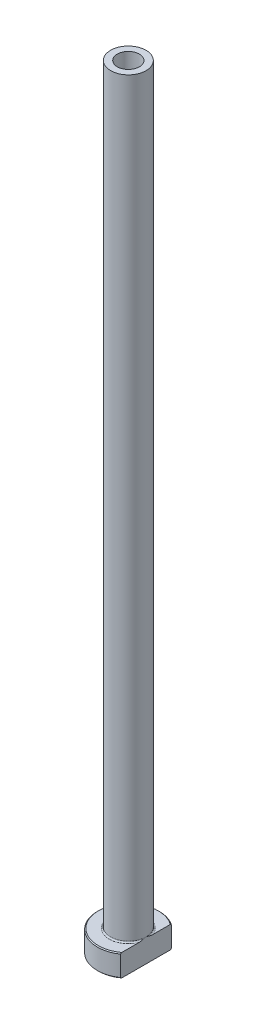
ISO-10303-21;
HEADER;
FILE_DESCRIPTION(('STEP AP214'),'2;1');
FILE_NAME('part.step','',(''),(''),'','','');
FILE_SCHEMA(('AUTOMOTIVE_DESIGN { 1 0 10303 214 1 1 1 1 }'));
ENDSEC;
DATA;
#1=APPLICATION_CONTEXT('core data for automotive mechanical design processes');
#2=APPLICATION_PROTOCOL_DEFINITION('international standard','automotive_design',2000,#1);
#3=PRODUCT_CONTEXT('',#1,'mechanical');
#4=PRODUCT('Part','Part','',(#3));
#5=PRODUCT_RELATED_PRODUCT_CATEGORY('part','',(#4));
#6=PRODUCT_DEFINITION_FORMATION('','',#4);
#7=PRODUCT_DEFINITION_CONTEXT('part definition',#1,'design');
#8=PRODUCT_DEFINITION('design','',#6,#7);
#9=PRODUCT_DEFINITION_SHAPE('','',#8);
#10=(LENGTH_UNIT() NAMED_UNIT(*) SI_UNIT(.MILLI.,.METRE.));
#11=(NAMED_UNIT(*) PLANE_ANGLE_UNIT() SI_UNIT($,.RADIAN.));
#12=(NAMED_UNIT(*) SI_UNIT($,.STERADIAN.) SOLID_ANGLE_UNIT());
#13=UNCERTAINTY_MEASURE_WITH_UNIT(LENGTH_MEASURE(1.E-05),#10,'distance_accuracy_value','');
#14=(GEOMETRIC_REPRESENTATION_CONTEXT(3) GLOBAL_UNCERTAINTY_ASSIGNED_CONTEXT((#13)) GLOBAL_UNIT_ASSIGNED_CONTEXT((#10,
#11,#12)) REPRESENTATION_CONTEXT('',''));
#15=CARTESIAN_POINT('',(0.,0.,0.));
#16=DIRECTION('',(0.,0.,1.));
#17=DIRECTION('',(1.,0.,0.));
#18=AXIS2_PLACEMENT_3D('',#15,#16,#17);
#19=CARTESIAN_POINT('',(0.,92.1876809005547,0.));
#20=DIRECTION('',(0.,1.,0.));
#21=DIRECTION('',(0.,0.,1.));
#22=AXIS2_PLACEMENT_3D('',#19,#20,#21);
#23=CYLINDRICAL_SURFACE('',#22,2.5);
#24=CARTESIAN_POINT('',(0.,175.,0.));
#25=DIRECTION('',(0.,1.,0.));
#26=DIRECTION('',(0.,0.,1.));
#27=AXIS2_PLACEMENT_3D('',#24,#25,#26);
#28=CIRCLE('',#27,2.5);
#29=CARTESIAN_POINT('',(0.,175.,2.5));
#30=VERTEX_POINT('',#29);
#31=EDGE_CURVE('E167',#30,#30,#28,.T.);
#32=ORIENTED_EDGE('',*,*,#31,.T.);
#33=EDGE_LOOP('',(#32));
#34=FACE_BOUND('',#33,.T.);
#35=CARTESIAN_POINT('',(0.,130.,0.));
#36=DIRECTION('',(0.,1.,0.));
#37=DIRECTION('',(0.,0.,1.));
#38=AXIS2_PLACEMENT_3D('',#35,#36,#37);
#39=CIRCLE('',#38,2.5);
#40=CARTESIAN_POINT('',(0.,130.,2.5));
#41=VERTEX_POINT('',#40);
#42=EDGE_CURVE('E170',#41,#41,#39,.T.);
#43=ORIENTED_EDGE('',*,*,#42,.F.);
#44=EDGE_LOOP('',(#43));
#45=FACE_BOUND('',#44,.T.);
#46=ADVANCED_FACE('F32',(#34,#45),#23,.F.);
#47=CARTESIAN_POINT('',(-2.5,175.,0.));
#48=DIRECTION('',(0.,1.,0.));
#49=DIRECTION('',(0.,0.,1.));
#50=AXIS2_PLACEMENT_3D('',#47,#48,#49);
#51=PLANE('',#50);
#52=CARTESIAN_POINT('',(0.,175.,0.));
#53=DIRECTION('',(0.,1.,0.));
#54=DIRECTION('',(0.,0.,1.));
#55=AXIS2_PLACEMENT_3D('',#52,#53,#54);
#56=CIRCLE('',#55,4.00000000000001);
#57=CARTESIAN_POINT('',(0.,175.,4.00000000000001));
#58=VERTEX_POINT('',#57);
#59=EDGE_CURVE('E174',#58,#58,#56,.T.);
#60=ORIENTED_EDGE('',*,*,#59,.T.);
#61=EDGE_LOOP('',(#60));
#62=FACE_BOUND('',#61,.T.);
#63=ORIENTED_EDGE('',*,*,#31,.F.);
#64=EDGE_LOOP('',(#63));
#65=FACE_BOUND('',#64,.T.);
#66=ADVANCED_FACE('F157',(#62,#65),#51,.T.);
#67=CARTESIAN_POINT('',(0.,92.1876809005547,0.));
#68=DIRECTION('',(0.,1.,0.));
#69=DIRECTION('',(0.,0.,1.));
#70=AXIS2_PLACEMENT_3D('',#67,#68,#69);
#71=CYLINDRICAL_SURFACE('',#70,4.);
#72=CARTESIAN_POINT('',(0.,5.3,0.));
#73=DIRECTION('',(0.,1.,0.));
#74=DIRECTION('',(0.,0.,1.));
#75=AXIS2_PLACEMENT_3D('',#72,#73,#74);
#76=CIRCLE('',#75,4.);
#77=CARTESIAN_POINT('',(4.,5.3,0.));
#78=VERTEX_POINT('',#77);
#79=EDGE_CURVE('E180',#78,#78,#76,.T.);
#80=ORIENTED_EDGE('',*,*,#79,.T.);
#81=EDGE_LOOP('',(#80));
#82=FACE_BOUND('',#81,.T.);
#83=ORIENTED_EDGE('',*,*,#59,.F.);
#84=EDGE_LOOP('',(#83));
#85=FACE_BOUND('',#84,.T.);
#86=ADVANCED_FACE('F162',(#82,#85),#71,.T.);
#87=CARTESIAN_POINT('',(-3.99999999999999,5.,0.));
#88=DIRECTION('',(0.,1.,0.));
#89=DIRECTION('',(0.,0.,1.));
#90=AXIS2_PLACEMENT_3D('',#87,#88,#89);
#91=PLANE('',#90);
#92=DIRECTION('',(0.,0.,1.));
#93=VECTOR('',#92,1.);
#94=CARTESIAN_POINT('',(4.,5.,0.));
#95=LINE('',#94,#93);
#96=CARTESIAN_POINT('',(4.,5.,-5.499090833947));
#97=VERTEX_POINT('',#96);
#98=CARTESIAN_POINT('',(4.,5.,-1.57797338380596));
#99=VERTEX_POINT('',#98);
#100=EDGE_CURVE('E54',#97,#99,#95,.T.);
#101=ORIENTED_EDGE('',*,*,#100,.F.);
#102=CARTESIAN_POINT('',(0.,5.,0.));
#103=DIRECTION('',(0.,1.,0.));
#104=DIRECTION('',(0.,0.,1.));
#105=AXIS2_PLACEMENT_3D('',#102,#103,#104);
#106=CIRCLE('',#105,6.79999999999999);
#107=CARTESIAN_POINT('',(3.99999999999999,5.,5.499090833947));
#108=VERTEX_POINT('',#107);
#109=EDGE_CURVE('E186',#97,#108,#106,.T.);
#110=ORIENTED_EDGE('',*,*,#109,.T.);
#111=CARTESIAN_POINT('',(4.,5.,1.57797338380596));
#112=VERTEX_POINT('',#111);
#113=EDGE_CURVE('E134',#112,#108,#95,.T.);
#114=ORIENTED_EDGE('',*,*,#113,.F.);
#115=CARTESIAN_POINT('',(0.,5.,0.));
#116=DIRECTION('',(0.,1.,0.));
#117=DIRECTION('',(0.,0.,1.));
#118=AXIS2_PLACEMENT_3D('',#115,#116,#117);
#119=CIRCLE('',#118,4.3);
#120=EDGE_CURVE('E183',#112,#99,#119,.F.);
#121=ORIENTED_EDGE('',*,*,#120,.T.);
#122=EDGE_LOOP('',(#101,#110,#114,#121));
#123=FACE_BOUND('',#122,.T.);
#124=ADVANCED_FACE('F197',(#123),#91,.T.);
#125=CARTESIAN_POINT('',(0.,92.1876809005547,0.));
#126=DIRECTION('',(0.,1.,0.));
#127=DIRECTION('',(0.,0.,1.));
#128=AXIS2_PLACEMENT_3D('',#125,#126,#127);
#129=CYLINDRICAL_SURFACE('',#128,6.99999999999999);
#130=DIRECTION('',(0.,-1.,0.));
#131=VECTOR('',#130,1.);
#132=CARTESIAN_POINT('',(3.99999999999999,175.,5.74456264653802));
#133=LINE('',#132,#131);
#134=CARTESIAN_POINT('',(3.99999999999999,4.79999999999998,5.74456264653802));
#135=VERTEX_POINT('',#134);
#136=CARTESIAN_POINT('',(3.99999999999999,0.20000000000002,5.74456264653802));
#137=VERTEX_POINT('',#136);
#138=EDGE_CURVE('E82',#135,#137,#133,.T.);
#139=ORIENTED_EDGE('',*,*,#138,.F.);
#140=CARTESIAN_POINT('',(0.,4.79999999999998,0.));
#141=DIRECTION('',(0.,1.,0.));
#142=DIRECTION('',(0.,0.,1.));
#143=AXIS2_PLACEMENT_3D('',#140,#141,#142);
#144=CIRCLE('',#143,6.99999999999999);
#145=CARTESIAN_POINT('',(4.,4.79999999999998,-5.74456264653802));
#146=VERTEX_POINT('',#145);
#147=EDGE_CURVE('E95',#135,#146,#144,.F.);
#148=ORIENTED_EDGE('',*,*,#147,.T.);
#149=DIRECTION('',(0.,-1.,0.));
#150=VECTOR('',#149,1.);
#151=CARTESIAN_POINT('',(4.,175.,-5.74456264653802));
#152=LINE('',#151,#150);
#153=CARTESIAN_POINT('',(4.,0.20000000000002,-5.74456264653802));
#154=VERTEX_POINT('',#153);
#155=EDGE_CURVE('E192',#146,#154,#152,.T.);
#156=ORIENTED_EDGE('',*,*,#155,.T.);
#157=CARTESIAN_POINT('',(0.,0.20000000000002,0.));
#158=DIRECTION('',(0.,-1.,0.));
#159=DIRECTION('',(0.,0.,-1.));
#160=AXIS2_PLACEMENT_3D('',#157,#158,#159);
#161=CIRCLE('',#160,6.99999999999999);
#162=EDGE_CURVE('E98',#154,#137,#161,.F.);
#163=ORIENTED_EDGE('',*,*,#162,.T.);
#164=EDGE_LOOP('',(#139,#148,#156,#163));
#165=FACE_BOUND('',#164,.T.);
#166=ADVANCED_FACE('F190',(#165),#129,.T.);
#167=CARTESIAN_POINT('',(-6.99999999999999,0.,0.));
#168=DIRECTION('',(0.,-1.,0.));
#169=DIRECTION('',(0.,0.,-1.));
#170=AXIS2_PLACEMENT_3D('',#167,#168,#169);
#171=PLANE('',#170);
#172=CARTESIAN_POINT('',(0.,0.,0.));
#173=DIRECTION('',(0.,-1.,0.));
#174=DIRECTION('',(0.,0.,-1.));
#175=AXIS2_PLACEMENT_3D('',#172,#173,#174);
#176=CIRCLE('',#175,3.24999999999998);
#177=CARTESIAN_POINT('',(0.,0.,-3.24999999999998));
#178=VERTEX_POINT('',#177);
#179=EDGE_CURVE('E40',#178,#178,#176,.F.);
#180=ORIENTED_EDGE('',*,*,#179,.T.);
#181=EDGE_LOOP('',(#180));
#182=FACE_BOUND('',#181,.T.);
#183=DIRECTION('',(0.,0.,-1.));
#184=VECTOR('',#183,1.);
#185=CARTESIAN_POINT('',(3.99999999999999,0.,5.74456264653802));
#186=LINE('',#185,#184);
#187=CARTESIAN_POINT('',(3.99999999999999,0.,5.49909083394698));
#188=VERTEX_POINT('',#187);
#189=CARTESIAN_POINT('',(4.,0.,-5.49909083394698));
#190=VERTEX_POINT('',#189);
#191=EDGE_CURVE('E47',#188,#190,#186,.T.);
#192=ORIENTED_EDGE('',*,*,#191,.F.);
#193=CARTESIAN_POINT('',(0.,0.,0.));
#194=DIRECTION('',(0.,-1.,0.));
#195=DIRECTION('',(0.,0.,-1.));
#196=AXIS2_PLACEMENT_3D('',#193,#194,#195);
#197=CIRCLE('',#196,6.79999999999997);
#198=EDGE_CURVE('E92',#188,#190,#197,.T.);
#199=ORIENTED_EDGE('',*,*,#198,.T.);
#200=EDGE_LOOP('',(#192,#199));
#201=FACE_BOUND('',#200,.T.);
#202=ADVANCED_FACE('F91',(#182,#201),#171,.T.);
#203=CARTESIAN_POINT('',(0.,92.1876809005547,0.));
#204=DIRECTION('',(0.,1.,0.));
#205=DIRECTION('',(0.,0.,1.));
#206=AXIS2_PLACEMENT_3D('',#203,#204,#205);
#207=CYLINDRICAL_SURFACE('',#206,2.75);
#208=CARTESIAN_POINT('',(0.,0.499999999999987,0.));
#209=DIRECTION('',(0.,-1.,0.));
#210=DIRECTION('',(0.,0.,-1.));
#211=AXIS2_PLACEMENT_3D('',#208,#209,#210);
#212=CIRCLE('',#211,2.75);
#213=CARTESIAN_POINT('',(0.,0.499999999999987,-2.75));
#214=VERTEX_POINT('',#213);
#215=EDGE_CURVE('E11',#214,#214,#212,.T.);
#216=ORIENTED_EDGE('',*,*,#215,.T.);
#217=EDGE_LOOP('',(#216));
#218=FACE_BOUND('',#217,.T.);
#219=CARTESIAN_POINT('',(0.,118.,0.));
#220=DIRECTION('',(0.,1.,0.));
#221=DIRECTION('',(0.,0.,1.));
#222=AXIS2_PLACEMENT_3D('',#219,#220,#221);
#223=CIRCLE('',#222,2.75);
#224=CARTESIAN_POINT('',(0.,118.,2.75));
#225=VERTEX_POINT('',#224);
#226=EDGE_CURVE('E172',#225,#225,#223,.T.);
#227=ORIENTED_EDGE('',*,*,#226,.T.);
#228=EDGE_LOOP('',(#227));
#229=FACE_BOUND('',#228,.T.);
#230=ADVANCED_FACE('F215',(#218,#229),#207,.F.);
#231=CARTESIAN_POINT('',(0.,118.,0.));
#232=DIRECTION('',(0.,-1.,0.));
#233=DIRECTION('',(0.,0.,-1.));
#234=AXIS2_PLACEMENT_3D('',#231,#232,#233);
#235=CONICAL_SURFACE('',#234,2.75,0.0208303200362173);
#236=ORIENTED_EDGE('',*,*,#42,.T.);
#237=EDGE_LOOP('',(#236));
#238=FACE_BOUND('',#237,.T.);
#239=ORIENTED_EDGE('',*,*,#226,.F.);
#240=EDGE_LOOP('',(#239));
#241=FACE_BOUND('',#240,.T.);
#242=ADVANCED_FACE('F111',(#238,#241),#235,.F.);
#243=CARTESIAN_POINT('',(0.,5.3,0.));
#244=DIRECTION('',(0.,1.,0.));
#245=DIRECTION('',(0.,0.,1.));
#246=AXIS2_PLACEMENT_3D('',#243,#244,#245);
#247=TOROIDAL_SURFACE('',#246,4.3,0.3);
#248=ORIENTED_EDGE('',*,*,#120,.F.);
#249=CARTESIAN_POINT('',(4.,5.3,0.));
#250=CARTESIAN_POINT('',(4.,5.30000062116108,-1.06261529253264E-10));
#251=CARTESIAN_POINT('',(4.,5.30000124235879,2.17726073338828E-07));
#252=CARTESIAN_POINT('',(4.,5.30000240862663,8.36141018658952E-07));
#253=CARTESIAN_POINT('',(4.,5.30000294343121,1.2501168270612E-06));
#254=CARTESIAN_POINT('',(4.,5.30000404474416,2.23959340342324E-06));
#255=CARTESIAN_POINT('',(4.,5.30000459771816,2.83084465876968E-06));
#256=CARTESIAN_POINT('',(4.,5.30000559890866,4.0651660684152E-06));
#257=CARTESIAN_POINT('',(4.,5.30000604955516,4.70640086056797E-06));
#258=CARTESIAN_POINT('',(4.,5.3000076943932,7.15677214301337E-06));
#259=CARTESIAN_POINT('',(4.,5.3000087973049,9.02995984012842E-06));
#260=CARTESIAN_POINT('',(4.,5.30001063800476,1.27664888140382E-05));
#261=CARTESIAN_POINT('',(4.,5.30001139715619,1.46197807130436E-05));
#262=CARTESIAN_POINT('',(4.,5.30001453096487,2.23679224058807E-05));
#263=CARTESIAN_POINT('',(4.,5.30001683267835,2.82968752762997E-05));
#264=CARTESIAN_POINT('',(4.,5.30002027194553,3.95668733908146E-05));
#265=CARTESIAN_POINT('',(4.,5.30002152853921,4.48715464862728E-05));
#266=CARTESIAN_POINT('',(4.,5.30003060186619,8.40118205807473E-05));
#267=CARTESIAN_POINT('',(4.,5.30003739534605,0.000118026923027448));
#268=CARTESIAN_POINT('',(4.,5.30006713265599,0.00025221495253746));
#269=CARTESIAN_POINT('',(4.,5.30009559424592,0.00035113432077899));
#270=CARTESIAN_POINT('',(3.99999999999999,5.30020622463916,0.000742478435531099));
#271=CARTESIAN_POINT('',(4.,5.30028475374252,0.00103561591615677));
#272=CARTESIAN_POINT('',(4.,5.30059889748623,0.00219920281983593));
#273=CARTESIAN_POINT('',(4.,5.3008390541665,0.00306873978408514));
#274=CARTESIAN_POINT('',(3.99999999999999,5.30183682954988,0.00669141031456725));
#275=CARTESIAN_POINT('',(4.,5.30258877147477,0.00944568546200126));
#276=CARTESIAN_POINT('',(4.,5.31066890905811,0.0390293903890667));
#277=CARTESIAN_POINT('',(4.,5.31802631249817,0.0658531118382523));
#278=CARTESIAN_POINT('',(3.99999999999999,5.3323967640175,0.118441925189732));
#279=CARTESIAN_POINT('',(4.,5.33941183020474,0.144206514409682));
#280=CARTESIAN_POINT('',(4.,5.35427366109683,0.199017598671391));
#281=CARTESIAN_POINT('',(4.,5.36211313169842,0.228066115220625));
#282=CARTESIAN_POINT('',(4.,5.3777634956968,0.28651184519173));
#283=CARTESIAN_POINT('',(4.,5.38557313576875,0.315909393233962));
#284=CARTESIAN_POINT('',(4.,5.40425662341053,0.386994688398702));
#285=CARTESIAN_POINT('',(4.,5.41505237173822,0.428703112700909));
#286=CARTESIAN_POINT('',(4.,5.43592310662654,0.511098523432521));
#287=CARTESIAN_POINT('',(4.,5.44600969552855,0.551782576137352));
#288=CARTESIAN_POINT('',(4.,5.47850986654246,0.686599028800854));
#289=CARTESIAN_POINT('',(4.,5.4997837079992,0.781011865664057));
#290=CARTESIAN_POINT('',(4.,5.53807543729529,0.971847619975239));
#291=CARTESIAN_POINT('',(4.,5.5550427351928,1.06828120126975));
#292=CARTESIAN_POINT('',(4.,5.5758240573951,1.21752725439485));
#293=CARTESIAN_POINT('',(4.,5.5820979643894,1.26999379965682));
#294=CARTESIAN_POINT('',(4.,5.59210686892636,1.37516324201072));
#295=CARTESIAN_POINT('',(4.,5.59584265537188,1.42786606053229));
#296=CARTESIAN_POINT('',(4.,5.60010438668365,1.53310673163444));
#297=CARTESIAN_POINT('',(4.,5.6006487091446,1.58564378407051));
#298=CARTESIAN_POINT('',(4.,5.59767158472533,1.69058605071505));
#299=CARTESIAN_POINT('',(4.,5.59415502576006,1.74299134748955));
#300=CARTESIAN_POINT('',(4.,5.58503062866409,1.81903290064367));
#301=CARTESIAN_POINT('',(4.,5.58157617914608,1.84292934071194));
#302=CARTESIAN_POINT('',(4.,5.57329952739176,1.89051061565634));
#303=CARTESIAN_POINT('',(4.,5.56847619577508,1.91419525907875));
#304=CARTESIAN_POINT('',(4.,5.5572664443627,1.96092888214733));
#305=CARTESIAN_POINT('',(4.,5.55089740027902,1.98398195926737));
#306=CARTESIAN_POINT('',(4.,5.53623434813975,2.02945550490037));
#307=CARTESIAN_POINT('',(4.,5.52794253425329,2.05187666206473));
#308=CARTESIAN_POINT('',(4.,5.50887098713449,2.09590631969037));
#309=CARTESIAN_POINT('',(4.,5.49806837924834,2.1175050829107));
#310=CARTESIAN_POINT('',(4.,5.4733340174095,2.15885583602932));
#311=CARTESIAN_POINT('',(4.,5.45941272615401,2.17861369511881));
#312=CARTESIAN_POINT('',(4.,5.43588221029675,2.20522942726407));
#313=CARTESIAN_POINT('',(4.,5.42781139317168,2.21344043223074));
#314=CARTESIAN_POINT('',(4.,5.4106511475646,2.22875149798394));
#315=CARTESIAN_POINT('',(4.,5.40156129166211,2.23585108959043));
#316=CARTESIAN_POINT('',(4.,5.38220524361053,2.24859694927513));
#317=CARTESIAN_POINT('',(4.,5.37192420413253,2.25422119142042));
#318=CARTESIAN_POINT('',(4.,5.35045072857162,2.26331064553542));
#319=CARTESIAN_POINT('',(4.,5.3392612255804,2.26678251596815));
#320=CARTESIAN_POINT('',(4.,5.31952044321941,2.27051268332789));
#321=CARTESIAN_POINT('',(4.,5.31108453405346,2.27139016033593));
#322=CARTESIAN_POINT('',(4.,5.29418624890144,2.27168963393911));
#323=CARTESIAN_POINT('',(4.,5.28572387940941,2.27111196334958));
#324=CARTESIAN_POINT('',(4.,5.26904138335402,2.26855580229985));
#325=CARTESIAN_POINT('',(4.,5.2608206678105,2.26658107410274));
#326=CARTESIAN_POINT('',(4.,5.2447821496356,2.26139496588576));
#327=CARTESIAN_POINT('',(4.,5.2369646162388,2.25818277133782));
#328=CARTESIAN_POINT('',(4.,5.21851235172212,2.24908332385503));
#329=CARTESIAN_POINT('',(4.,5.20815219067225,2.24264095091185));
#330=CARTESIAN_POINT('',(4.,5.1885797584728,2.22819957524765));
#331=CARTESIAN_POINT('',(4.,5.17937061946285,2.22019647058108));
#332=CARTESIAN_POINT('',(4.,5.1566538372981,2.19777756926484));
#333=CARTESIAN_POINT('',(4.,5.14403484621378,2.18246908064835));
#334=CARTESIAN_POINT('',(4.,5.12118369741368,2.15020843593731));
#335=CARTESIAN_POINT('',(4.,5.1109548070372,2.13325407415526));
#336=CARTESIAN_POINT('',(4.,5.09273574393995,2.09892324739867));
#337=CARTESIAN_POINT('',(4.,5.08468212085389,2.08157988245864));
#338=CARTESIAN_POINT('',(4.,5.07005901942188,2.04627072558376));
#339=CARTESIAN_POINT('',(4.,5.06349101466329,2.02830433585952));
#340=CARTESIAN_POINT('',(4.,5.04555485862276,1.97350761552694));
#341=CARTESIAN_POINT('',(4.,5.03608974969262,1.93605770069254));
#342=CARTESIAN_POINT('',(4.,5.01780569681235,1.84529235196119));
#343=CARTESIAN_POINT('',(4.,5.01077018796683,1.79164082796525));
#344=CARTESIAN_POINT('',(4.,5.00182846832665,1.68379947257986));
#345=CARTESIAN_POINT('',(4.,4.99993887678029,1.62960846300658));
#346=CARTESIAN_POINT('',(4.,5.0000612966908,1.52361204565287));
#347=CARTESIAN_POINT('',(4.,5.00190698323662,1.47180551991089));
#348=CARTESIAN_POINT('',(4.,5.00841243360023,1.36835357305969));
#349=CARTESIAN_POINT('',(4.,5.01307376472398,1.31670825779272));
#350=CARTESIAN_POINT('',(4.,5.02905484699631,1.17431887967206));
#351=CARTESIAN_POINT('',(4.,5.04274090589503,1.08384207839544));
#352=CARTESIAN_POINT('',(4.,5.06701714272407,0.947757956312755));
#353=CARTESIAN_POINT('',(4.,5.07585573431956,0.901814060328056));
#354=CARTESIAN_POINT('',(4.,5.09458665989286,0.810008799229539));
#355=CARTESIAN_POINT('',(4.,5.10448180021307,0.764148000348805));
#356=CARTESIAN_POINT('',(4.,5.12892434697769,0.655631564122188));
#357=CARTESIAN_POINT('',(3.99999999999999,5.14383556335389,0.593058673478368));
#358=CARTESIAN_POINT('',(4.,5.17458762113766,0.468885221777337));
#359=CARTESIAN_POINT('',(4.,5.19041623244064,0.407281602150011));
#360=CARTESIAN_POINT('',(3.99999999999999,5.22090834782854,0.291232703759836));
#361=CARTESIAN_POINT('',(3.99999999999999,5.23550024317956,0.2367683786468));
#362=CARTESIAN_POINT('',(4.00000000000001,5.26562550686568,0.125604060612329));
#363=CARTESIAN_POINT('',(4.00000000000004,5.28117250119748,0.0689076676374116));
#364=CARTESIAN_POINT('',(3.99999999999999,5.29741226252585,0.00944154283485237));
#365=CARTESIAN_POINT('',(3.99999999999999,5.29816540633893,0.00668315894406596));
#366=CARTESIAN_POINT('',(4.,5.29916346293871,0.00305954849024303));
#367=CARTESIAN_POINT('',(4.,5.29940273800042,0.00219318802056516));
#368=CARTESIAN_POINT('',(3.99999999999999,5.29971580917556,0.00103357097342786));
#369=CARTESIAN_POINT('',(3.99999999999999,5.29979412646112,0.000741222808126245));
#370=CARTESIAN_POINT('',(4.,5.29990450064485,0.00035080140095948));
#371=CARTESIAN_POINT('',(4.,5.29993292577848,0.000252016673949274));
#372=CARTESIAN_POINT('',(3.99999999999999,5.29996263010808,0.000117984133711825));
#373=CARTESIAN_POINT('',(3.99999999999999,5.29996941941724,8.39881898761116E-05));
#374=CARTESIAN_POINT('',(4.,5.29997848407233,4.48674015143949E-05));
#375=CARTESIAN_POINT('',(4.,5.29997973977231,3.95638189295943E-05));
#376=CARTESIAN_POINT('',(4.,5.29998317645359,2.8296033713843E-05));
#377=CARTESIAN_POINT('',(4.,5.29998547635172,2.23681454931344E-05));
#378=CARTESIAN_POINT('',(4.,5.29998860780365,1.46211000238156E-05));
#379=CARTESIAN_POINT('',(4.,5.29998936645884,1.2767889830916E-05));
#380=CARTESIAN_POINT('',(4.,5.29999120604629,9.03144036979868E-06));
#381=CARTESIAN_POINT('',(4.,5.29999230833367,7.15824074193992E-06));
#382=CARTESIAN_POINT('',(4.,5.29999395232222,4.70775514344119E-06));
#383=CARTESIAN_POINT('',(4.,5.29999440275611,4.06646377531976E-06));
#384=CARTESIAN_POINT('',(4.,5.29999540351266,2.83199084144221E-06));
#385=CARTESIAN_POINT('',(4.,5.29999595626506,2.24064341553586E-06));
#386=CARTESIAN_POINT('',(4.,5.2999970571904,1.25093972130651E-06));
#387=CARTESIAN_POINT('',(4.,5.29999759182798,8.36841075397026E-07));
#388=CARTESIAN_POINT('',(4.,5.29999875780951,2.18117755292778E-07));
#389=CARTESIAN_POINT('',(4.,5.29999937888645,1.06254606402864E-10));
#390=CARTESIAN_POINT('',(4.,5.3,0.));
#391=B_SPLINE_CURVE_WITH_KNOTS('',3,(#249,#250,#251,#252,#253,#254,#255,#256,#257,#258,#259,
#260,#261,#262,#263,#264,#265,#266,#267,#268,#269,#270,#271,#272,#273,#274,#275,#276,#277,#278,
#279,#280,#281,#282,#283,#284,#285,#286,#287,#288,#289,#290,#291,#292,#293,#294,#295,#296,#297,
#298,#299,#300,#301,#302,#303,#304,#305,#306,#307,#308,#309,#310,#311,#312,#313,#314,#315,#316,
#317,#318,#319,#320,#321,#322,#323,#324,#325,#326,#327,#328,#329,#330,#331,#332,#333,#334,#335,
#336,#337,#338,#339,#340,#341,#342,#343,#344,#345,#346,#347,#348,#349,#350,#351,#352,#353,#354,
#355,#356,#357,#358,#359,#360,#361,#362,#363,#364,#365,#366,#367,#368,#369,#370,#371,#372,#373,
#374,#375,#376,#377,#378,#379,#380,#381,#382,#383,#384,#385,#386,#387,#388,#389,#390),
.UNSPECIFIED.,.T.,.F.,(4,2,2,2,2,2,2,2,2,2,2,2,2,2,2,2,2,2,2,2,2,2,2,2,2,2,2,2,2,2,2,2,2,2,2,2,
2,2,2,2,2,2,2,2,2,2,2,2,2,2,2,2,2,2,2,2,2,2,2,2,2,2,2,2,2,2,2,2,2,2,4),(0.,1.87484430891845E-06,
3.90180055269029E-06,6.31683886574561E-06,8.66652039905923E-06,1.51627563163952E-05,
2.1165794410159E-05,4.020907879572E-05,5.65429486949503E-05,0.000160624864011,
0.000469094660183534,0.00137985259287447,0.00408571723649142,0.0126514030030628,
0.0960918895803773,0.176200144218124,0.266463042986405,0.357714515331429,0.486961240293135,
0.61270708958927,0.902988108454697,1.196535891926,1.35501075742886,1.51343634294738,
1.67094875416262,1.82827177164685,1.90067591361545,1.97313996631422,2.04482437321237,
2.11642737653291,2.18871023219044,2.26075412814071,2.29521947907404,2.32969934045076,
2.36466792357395,2.39952778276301,2.42485422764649,2.45017488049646,2.47542760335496,
2.50069697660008,2.53708899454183,2.57357798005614,2.63276032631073,2.69202310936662,
2.74930315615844,2.80663977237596,2.92223125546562,3.08420752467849,3.24670629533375,
3.40212850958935,3.55763731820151,3.83192962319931,3.97228382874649,4.11302057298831,
4.30598130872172,4.49678885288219,4.66594443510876,4.84230602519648,4.85088453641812,
4.85358051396,4.8544888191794,4.85479687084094,4.8549008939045,4.8549172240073,4.85493626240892,
4.85494226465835,4.85494875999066,4.85495110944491,4.85495352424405,4.85495555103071,
4.85495742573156),.UNSPECIFIED.);
#392=EDGE_CURVE('E126',#112,#78,#391,.T.);
#393=ORIENTED_EDGE('',*,*,#392,.T.);
#394=ORIENTED_EDGE('',*,*,#79,.F.);
#395=CARTESIAN_POINT('',(4.,5.3,0.));
#396=CARTESIAN_POINT('',(4.,5.29999937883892,1.06262853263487E-10));
#397=CARTESIAN_POINT('',(4.,5.29999875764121,-2.17726072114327E-07));
#398=CARTESIAN_POINT('',(4.,5.29999759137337,-8.36141017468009E-07));
#399=CARTESIAN_POINT('',(4.,5.29999705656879,-1.25011682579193E-06));
#400=CARTESIAN_POINT('',(4.,5.29999595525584,-2.23959340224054E-06));
#401=CARTESIAN_POINT('',(4.,5.29999540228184,-2.83084465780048E-06));
#402=CARTESIAN_POINT('',(4.,5.29999440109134,-4.06516606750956E-06));
#403=CARTESIAN_POINT('',(4.,5.29999395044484,-4.70640085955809E-06));
#404=CARTESIAN_POINT('',(4.,5.2999923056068,-7.15677214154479E-06));
#405=CARTESIAN_POINT('',(4.,5.2999912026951,-9.02995983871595E-06));
#406=CARTESIAN_POINT('',(4.,5.29998936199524,-1.27664888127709E-05));
#407=CARTESIAN_POINT('',(4.,5.29998860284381,-1.46197807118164E-05));
#408=CARTESIAN_POINT('',(4.,5.29998546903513,-2.2367922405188E-05));
#409=CARTESIAN_POINT('',(4.,5.29998316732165,-2.82968752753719E-05));
#410=CARTESIAN_POINT('',(4.,5.29997972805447,-3.95668733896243E-05));
#411=CARTESIAN_POINT('',(4.,5.29997847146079,-4.48715464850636E-05));
#412=CARTESIAN_POINT('',(4.,5.29996939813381,-8.40118205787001E-05));
#413=CARTESIAN_POINT('',(4.,5.29996260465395,-0.000118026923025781));
#414=CARTESIAN_POINT('',(4.,5.29993286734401,-0.000252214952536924));
#415=CARTESIAN_POINT('',(4.,5.29990440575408,-0.000351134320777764));
#416=CARTESIAN_POINT('',(3.99999999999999,5.29979377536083,-0.000742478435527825));
#417=CARTESIAN_POINT('',(4.,5.29971524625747,-0.00103561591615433));
#418=CARTESIAN_POINT('',(4.,5.29940110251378,-0.00219920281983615));
#419=CARTESIAN_POINT('',(4.,5.2991609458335,-0.00306873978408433));
#420=CARTESIAN_POINT('',(3.99999999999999,5.29816317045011,-0.00669141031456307));
#421=CARTESIAN_POINT('',(4.,5.29741122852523,-0.00944568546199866));
#422=CARTESIAN_POINT('',(4.,5.28933109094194,-0.0390293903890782));
#423=CARTESIAN_POINT('',(4.,5.28197368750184,-0.0658531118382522));
#424=CARTESIAN_POINT('',(3.99999999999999,5.26760323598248,-0.118441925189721));
#425=CARTESIAN_POINT('',(4.,5.26058816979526,-0.144206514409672));
#426=CARTESIAN_POINT('',(4.,5.24572633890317,-0.199017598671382));
#427=CARTESIAN_POINT('',(4.,5.23788686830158,-0.228066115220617));
#428=CARTESIAN_POINT('',(4.,5.2222365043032,-0.286511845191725));
#429=CARTESIAN_POINT('',(4.,5.21442686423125,-0.315909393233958));
#430=CARTESIAN_POINT('',(4.,5.19574337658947,-0.386994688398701));
#431=CARTESIAN_POINT('',(4.,5.18494762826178,-0.428703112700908));
#432=CARTESIAN_POINT('',(4.,5.16407689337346,-0.511098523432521));
#433=CARTESIAN_POINT('',(4.,5.15399030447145,-0.551782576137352));
#434=CARTESIAN_POINT('',(4.,5.12149013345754,-0.686599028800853));
#435=CARTESIAN_POINT('',(4.,5.1002162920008,-0.781011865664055));
#436=CARTESIAN_POINT('',(4.,5.06192456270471,-0.971847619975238));
#437=CARTESIAN_POINT('',(4.,5.0449572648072,-1.06828120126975));
#438=CARTESIAN_POINT('',(4.,5.02417594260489,-1.21752725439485));
#439=CARTESIAN_POINT('',(4.,5.01790203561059,-1.26999379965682));
#440=CARTESIAN_POINT('',(4.,5.00789313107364,-1.37516324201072));
#441=CARTESIAN_POINT('',(4.,5.00415734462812,-1.42786606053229));
#442=CARTESIAN_POINT('',(4.,4.99989561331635,-1.53310673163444));
#443=CARTESIAN_POINT('',(4.,4.9993512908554,-1.58564378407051));
#444=CARTESIAN_POINT('',(4.,5.00232841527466,-1.69058605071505));
#445=CARTESIAN_POINT('',(4.,5.00584497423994,-1.74299134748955));
#446=CARTESIAN_POINT('',(4.,5.0149693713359,-1.81903290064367));
#447=CARTESIAN_POINT('',(4.,5.01842382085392,-1.84292934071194));
#448=CARTESIAN_POINT('',(4.,5.02670047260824,-1.89051061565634));
#449=CARTESIAN_POINT('',(4.,5.03152380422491,-1.91419525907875));
#450=CARTESIAN_POINT('',(4.,5.0427335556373,-1.96092888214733));
#451=CARTESIAN_POINT('',(4.,5.04910259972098,-1.98398195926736));
#452=CARTESIAN_POINT('',(4.,5.06376565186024,-2.02945550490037));
#453=CARTESIAN_POINT('',(4.,5.07205746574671,-2.05187666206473));
#454=CARTESIAN_POINT('',(4.,5.09112901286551,-2.09590631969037));
#455=CARTESIAN_POINT('',(4.,5.10193162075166,-2.1175050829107));
#456=CARTESIAN_POINT('',(4.,5.1266659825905,-2.15885583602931));
#457=CARTESIAN_POINT('',(4.,5.14058727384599,-2.17861369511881));
#458=CARTESIAN_POINT('',(4.,5.16411778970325,-2.20522942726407));
#459=CARTESIAN_POINT('',(4.,5.17218860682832,-2.21344043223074));
#460=CARTESIAN_POINT('',(4.,5.1893488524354,-2.22875149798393));
#461=CARTESIAN_POINT('',(4.,5.19843870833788,-2.23585108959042));
#462=CARTESIAN_POINT('',(4.,5.21779475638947,-2.24859694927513));
#463=CARTESIAN_POINT('',(4.,5.22807579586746,-2.25422119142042));
#464=CARTESIAN_POINT('',(4.,5.24954927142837,-2.26331064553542));
#465=CARTESIAN_POINT('',(4.,5.2607387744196,-2.26678251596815));
#466=CARTESIAN_POINT('',(4.,5.28047955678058,-2.27051268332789));
#467=CARTESIAN_POINT('',(4.,5.28891546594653,-2.27139016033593));
#468=CARTESIAN_POINT('',(4.,5.30581375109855,-2.27168963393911));
#469=CARTESIAN_POINT('',(4.,5.31427612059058,-2.27111196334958));
#470=CARTESIAN_POINT('',(4.,5.33095861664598,-2.26855580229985));
#471=CARTESIAN_POINT('',(4.,5.3391793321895,-2.26658107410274));
#472=CARTESIAN_POINT('',(4.,5.35521785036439,-2.26139496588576));
#473=CARTESIAN_POINT('',(4.,5.3630353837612,-2.25818277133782));
#474=CARTESIAN_POINT('',(4.,5.38148764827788,-2.24908332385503));
#475=CARTESIAN_POINT('',(4.,5.39184780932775,-2.24264095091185));
#476=CARTESIAN_POINT('',(4.,5.4114202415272,-2.22819957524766));
#477=CARTESIAN_POINT('',(4.,5.42062938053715,-2.22019647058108));
#478=CARTESIAN_POINT('',(4.,5.44334616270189,-2.19777756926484));
#479=CARTESIAN_POINT('',(4.,5.45596515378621,-2.18246908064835));
#480=CARTESIAN_POINT('',(4.,5.47881630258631,-2.15020843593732));
#481=CARTESIAN_POINT('',(4.,5.48904519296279,-2.13325407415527));
#482=CARTESIAN_POINT('',(4.,5.50726425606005,-2.09892324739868));
#483=CARTESIAN_POINT('',(4.,5.51531787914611,-2.08157988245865));
#484=CARTESIAN_POINT('',(4.,5.52994098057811,-2.04627072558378));
#485=CARTESIAN_POINT('',(4.,5.5365089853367,-2.02830433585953));
#486=CARTESIAN_POINT('',(4.,5.55444514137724,-1.97350761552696));
#487=CARTESIAN_POINT('',(4.,5.56391025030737,-1.93605770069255));
#488=CARTESIAN_POINT('',(4.,5.58219430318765,-1.84529235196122));
#489=CARTESIAN_POINT('',(4.,5.58922981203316,-1.79164082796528));
#490=CARTESIAN_POINT('',(4.,5.59817153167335,-1.68379947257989));
#491=CARTESIAN_POINT('',(4.,5.60006112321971,-1.62960846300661));
#492=CARTESIAN_POINT('',(4.,5.5999387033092,-1.52361204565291));
#493=CARTESIAN_POINT('',(4.,5.59809301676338,-1.47180551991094));
#494=CARTESIAN_POINT('',(4.,5.59158756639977,-1.36835357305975));
#495=CARTESIAN_POINT('',(4.,5.58692623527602,-1.31670825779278));
#496=CARTESIAN_POINT('',(4.,5.57094515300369,-1.17431887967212));
#497=CARTESIAN_POINT('',(4.,5.55725909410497,-1.08384207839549));
#498=CARTESIAN_POINT('',(4.,5.53298285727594,-0.947757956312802));
#499=CARTESIAN_POINT('',(4.,5.52414426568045,-0.901814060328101));
#500=CARTESIAN_POINT('',(4.,5.50541334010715,-0.810008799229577));
#501=CARTESIAN_POINT('',(4.,5.49551819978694,-0.764148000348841));
#502=CARTESIAN_POINT('',(4.,5.47107565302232,-0.655631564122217));
#503=CARTESIAN_POINT('',(4.,5.45616443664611,-0.593058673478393));
#504=CARTESIAN_POINT('',(4.,5.42541237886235,-0.468885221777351));
#505=CARTESIAN_POINT('',(4.,5.40958376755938,-0.407281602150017));
#506=CARTESIAN_POINT('',(3.99999999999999,5.37909165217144,-0.291232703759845));
#507=CARTESIAN_POINT('',(3.99999999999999,5.36449975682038,-0.236768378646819));
#508=CARTESIAN_POINT('',(4.,5.33437449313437,-0.125604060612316));
#509=CARTESIAN_POINT('',(4.,5.31882749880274,-0.0689076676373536));
#510=CARTESIAN_POINT('',(4.,5.30258773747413,-0.00944154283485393));
#511=CARTESIAN_POINT('',(3.99999999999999,5.30183459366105,-0.00668315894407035));
#512=CARTESIAN_POINT('',(4.,5.30083653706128,-0.00305954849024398));
#513=CARTESIAN_POINT('',(4.,5.30059726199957,-0.00219318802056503));
#514=CARTESIAN_POINT('',(4.,5.30028419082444,-0.0010335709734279));
#515=CARTESIAN_POINT('',(3.99999999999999,5.30020587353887,-0.000741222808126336));
#516=CARTESIAN_POINT('',(4.,5.30009549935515,-0.000350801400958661));
#517=CARTESIAN_POINT('',(4.,5.30006707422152,-0.000252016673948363));
#518=CARTESIAN_POINT('',(4.,5.30003736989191,-0.000117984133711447));
#519=CARTESIAN_POINT('',(4.,5.30003058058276,-8.39881898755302E-05));
#520=CARTESIAN_POINT('',(4.,5.30002151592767,-4.48674015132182E-05));
#521=CARTESIAN_POINT('',(4.,5.30002026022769,-3.95638189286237E-05));
#522=CARTESIAN_POINT('',(4.,5.30001682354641,-2.82960337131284E-05));
#523=CARTESIAN_POINT('',(4.,5.30001452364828,-2.23681454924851E-05));
#524=CARTESIAN_POINT('',(4.,5.30001139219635,-1.46211000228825E-05));
#525=CARTESIAN_POINT('',(4.,5.30001063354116,-1.27678898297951E-05));
#526=CARTESIAN_POINT('',(4.,5.30000879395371,-9.03144036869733E-06));
#527=CARTESIAN_POINT('',(4.,5.30000769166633,-7.15824074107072E-06));
#528=CARTESIAN_POINT('',(4.,5.30000604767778,-4.70775514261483E-06));
#529=CARTESIAN_POINT('',(4.,5.30000559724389,-4.06646377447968E-06));
#530=CARTESIAN_POINT('',(4.,5.30000459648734,-2.83199084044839E-06));
#531=CARTESIAN_POINT('',(4.,5.30000404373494,-2.24064341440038E-06));
#532=CARTESIAN_POINT('',(4.,5.3000029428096,-1.25093971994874E-06));
#533=CARTESIAN_POINT('',(4.,5.30000240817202,-8.36841073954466E-07));
#534=CARTESIAN_POINT('',(4.,5.30000124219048,-2.18117754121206E-07));
#535=CARTESIAN_POINT('',(4.,5.30000062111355,-1.06253514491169E-10));
#536=CARTESIAN_POINT('',(4.,5.3,0.));
#537=B_SPLINE_CURVE_WITH_KNOTS('',3,(#395,#396,#397,#398,#399,#400,#401,#402,#403,#404,#405,
#406,#407,#408,#409,#410,#411,#412,#413,#414,#415,#416,#417,#418,#419,#420,#421,#422,#423,#424,
#425,#426,#427,#428,#429,#430,#431,#432,#433,#434,#435,#436,#437,#438,#439,#440,#441,#442,#443,
#444,#445,#446,#447,#448,#449,#450,#451,#452,#453,#454,#455,#456,#457,#458,#459,#460,#461,#462,
#463,#464,#465,#466,#467,#468,#469,#470,#471,#472,#473,#474,#475,#476,#477,#478,#479,#480,#481,
#482,#483,#484,#485,#486,#487,#488,#489,#490,#491,#492,#493,#494,#495,#496,#497,#498,#499,#500,
#501,#502,#503,#504,#505,#506,#507,#508,#509,#510,#511,#512,#513,#514,#515,#516,#517,#518,#519,
#520,#521,#522,#523,#524,#525,#526,#527,#528,#529,#530,#531,#532,#533,#534,#535,#536),
.UNSPECIFIED.,.T.,.F.,(4,2,2,2,2,2,2,2,2,2,2,2,2,2,2,2,2,2,2,2,2,2,2,2,2,2,2,2,2,2,2,2,2,2,2,2,
2,2,2,2,2,2,2,2,2,2,2,2,2,2,2,2,2,2,2,2,2,2,2,2,2,2,2,2,2,2,2,2,2,2,4),(0.,1.87484430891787E-06,
3.90180055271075E-06,6.31683886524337E-06,8.66652039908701E-06,1.51627563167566E-05,
2.11657944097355E-05,4.0209078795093E-05,5.6542948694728E-05,0.000160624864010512,
0.000469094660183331,0.00137985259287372,0.00408571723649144,0.0126514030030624,
0.0960918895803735,0.176200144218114,0.2664630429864,0.357714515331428,0.486961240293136,
0.61270708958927,0.902988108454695,1.196535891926,1.35501075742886,1.51343634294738,
1.67094875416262,1.82827177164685,1.90067591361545,1.97313996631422,2.04482437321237,
2.1164273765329,2.18871023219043,2.26075412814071,2.29521947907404,2.32969934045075,
2.36466792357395,2.39952778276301,2.42485422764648,2.45017488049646,2.47542760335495,
2.50069697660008,2.53708899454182,2.57357798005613,2.63276032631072,2.69202310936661,
2.74930315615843,2.80663977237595,2.9222312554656,3.08420752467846,3.24670629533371,
3.40212850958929,3.55763731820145,3.83192962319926,3.97228382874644,4.11302057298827,
4.3059813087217,4.49678885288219,4.66594443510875,4.84230602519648,4.85088453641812,
4.85358051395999,4.85448881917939,4.85479687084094,4.8549008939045,4.8549172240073,
4.85493626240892,4.85494226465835,4.85494875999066,4.85495110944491,4.85495352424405,
4.85495555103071,4.85495742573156),.UNSPECIFIED.);
#538=EDGE_CURVE('E135',#78,#99,#537,.T.);
#539=ORIENTED_EDGE('',*,*,#538,.T.);
#540=EDGE_LOOP('',(#248,#393,#394,#539));
#541=FACE_BOUND('',#540,.T.);
#542=ADVANCED_FACE('F141',(#541),#247,.F.);
#543=CARTESIAN_POINT('',(0.,5.,0.));
#544=DIRECTION('',(0.,-1.,0.));
#545=DIRECTION('',(0.,0.,-1.));
#546=AXIS2_PLACEMENT_3D('',#543,#544,#545);
#547=CONICAL_SURFACE('',#546,6.79999999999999,0.785398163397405);
#548=CARTESIAN_POINT('',(4.,-1.45712845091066,-12.6392822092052));
#549=CARTESIAN_POINT('',(4.,-1.24364466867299,-12.4153556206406));
#550=CARTESIAN_POINT('',(4.,-1.03042430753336,-12.1911774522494));
#551=CARTESIAN_POINT('',(4.,-0.604617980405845,-11.7422167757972));
#552=CARTESIAN_POINT('',(4.,-0.392032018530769,-11.5174342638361));
#553=CARTESIAN_POINT('',(4.,0.0324624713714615,-11.0670952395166));
#554=CARTESIAN_POINT('',(4.,0.244370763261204,-10.8415385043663));
#555=CARTESIAN_POINT('',(4.,0.667290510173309,-10.3895875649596));
#556=CARTESIAN_POINT('',(4.,0.878301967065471,-10.1631933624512));
#557=CARTESIAN_POINT('',(4.,1.51385375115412,-9.47810122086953));
#558=CARTESIAN_POINT('',(4.,1.93676291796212,-9.017882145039));
#559=CARTESIAN_POINT('',(4.,2.56612335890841,-8.32309905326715));
#560=CARTESIAN_POINT('',(4.,2.77505666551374,-8.09078457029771));
#561=CARTESIAN_POINT('',(4.,3.19080254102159,-7.62426940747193));
#562=CARTESIAN_POINT('',(4.,3.39761512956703,-7.39006874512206));
#563=CARTESIAN_POINT('',(4.,3.87870763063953,-6.83891844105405));
#564=CARTESIAN_POINT('',(4.,4.15190978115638,-6.52102188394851));
#565=CARTESIAN_POINT('',(4.,4.55642425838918,-6.03960901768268));
#566=CARTESIAN_POINT('',(4.,4.69041050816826,-5.87833992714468));
#567=CARTESIAN_POINT('',(4.,4.95616531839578,-5.55398469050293));
#568=CARTESIAN_POINT('',(4.,5.08793391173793,-5.39089857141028));
#569=CARTESIAN_POINT('',(4.,5.34841712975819,-5.06288801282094));
#570=CARTESIAN_POINT('',(4.,5.47713786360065,-4.89796843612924));
#571=CARTESIAN_POINT('',(4.,5.73107494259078,-4.56545535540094));
#572=CARTESIAN_POINT('',(4.,5.85629144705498,-4.39786197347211));
#573=CARTESIAN_POINT('',(4.,6.10211465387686,-4.05948444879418));
#574=CARTESIAN_POINT('',(4.,6.22272435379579,-3.88870249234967));
#575=CARTESIAN_POINT('',(4.,6.45796076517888,-3.5430831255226));
#576=CARTESIAN_POINT('',(4.,6.57258867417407,-3.3682465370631));
#577=CARTESIAN_POINT('',(4.,6.76866603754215,-3.05381396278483));
#578=CARTESIAN_POINT('',(4.,6.85173773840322,-2.9152335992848));
#579=CARTESIAN_POINT('',(4.,7.01174537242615,-2.63451965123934));
#580=CARTESIAN_POINT('',(4.,7.08868042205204,-2.49238555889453));
#581=CARTESIAN_POINT('',(4.,7.23459437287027,-2.20416961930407));
#582=CARTESIAN_POINT('',(4.,7.3035783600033,-2.05809037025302));
#583=CARTESIAN_POINT('',(4.,7.43135520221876,-1.7615173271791));
#584=CARTESIAN_POINT('',(4.,7.49015114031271,-1.61102488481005));
#585=CARTESIAN_POINT('',(4.,7.58249315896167,-1.3414209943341));
#586=CARTESIAN_POINT('',(4.,7.6187266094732,-1.22323501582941));
#587=CARTESIAN_POINT('',(4.,7.68223354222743,-0.984492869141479));
#588=CARTESIAN_POINT('',(4.,7.70951040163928,-0.863937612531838));
#589=CARTESIAN_POINT('',(4.,7.75377914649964,-0.621342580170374));
#590=CARTESIAN_POINT('',(4.,7.77080509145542,-0.499309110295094));
#591=CARTESIAN_POINT('',(4.,7.79378778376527,-0.25419448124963));
#592=CARTESIAN_POINT('',(4.,7.79974523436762,-0.13111338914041));
#593=CARTESIAN_POINT('',(4.,7.8002395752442,0.115517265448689));
#594=CARTESIAN_POINT('',(4.,7.79473514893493,0.239066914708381));
#595=CARTESIAN_POINT('',(4.,7.77255119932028,0.485148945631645));
#596=CARTESIAN_POINT('',(4.,7.75587091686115,0.60768125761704));
#597=CARTESIAN_POINT('',(4.,7.71218353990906,0.851269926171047));
#598=CARTESIAN_POINT('',(4.,7.68514362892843,0.972320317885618));
#599=CARTESIAN_POINT('',(4.,7.62201202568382,1.21200276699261));
#600=CARTESIAN_POINT('',(4.,7.5859196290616,1.3306346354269));
#601=CARTESIAN_POINT('',(4.,7.45980070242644,1.70122439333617));
#602=CARTESIAN_POINT('',(4.,7.35572950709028,1.94843335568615));
#603=CARTESIAN_POINT('',(4.,7.18186715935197,2.31048534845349));
#604=CARTESIAN_POINT('',(4.,7.12087684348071,2.42983561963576));
#605=CARTESIAN_POINT('',(4.,6.99403531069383,2.66593629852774));
#606=CARTESIAN_POINT('',(3.99999999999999,6.92818466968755,2.78268701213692));
#607=CARTESIAN_POINT('',(3.99999999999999,6.79157875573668,3.01550895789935));
#608=CARTESIAN_POINT('',(3.99999999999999,6.72076681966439,3.1315466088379));
#609=CARTESIAN_POINT('',(3.99999999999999,6.5758311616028,3.36153379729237));
#610=CARTESIAN_POINT('',(3.99999999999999,6.50170736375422,3.47548328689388));
#611=CARTESIAN_POINT('',(3.99999999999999,6.35080982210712,3.70145107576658));
#612=CARTESIAN_POINT('',(3.99999999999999,6.27403866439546,3.8134711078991));
#613=CARTESIAN_POINT('',(3.99999999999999,6.11824120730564,4.03592316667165));
#614=CARTESIAN_POINT('',(3.99999999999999,6.03921496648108,4.14635523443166));
#615=CARTESIAN_POINT('',(3.99999999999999,5.81506547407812,4.45397159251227));
#616=CARTESIAN_POINT('',(3.99999999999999,5.66782256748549,4.6496112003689));
#617=CARTESIAN_POINT('',(3.99999999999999,5.36880597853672,5.03740600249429));
#618=CARTESIAN_POINT('',(3.99999999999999,5.21703183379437,5.22956083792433));
#619=CARTESIAN_POINT('',(3.99999999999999,4.90999105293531,5.61115465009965));
#620=CARTESIAN_POINT('',(3.99999999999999,4.75472331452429,5.80059273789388));
#621=CARTESIAN_POINT('',(3.99999999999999,4.44150758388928,6.17724364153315));
#622=CARTESIAN_POINT('',(3.99999999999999,4.28355951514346,6.36445639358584));
#623=CARTESIAN_POINT('',(3.99999999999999,3.96525805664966,6.73740614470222));
#624=CARTESIAN_POINT('',(3.99999999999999,3.80490084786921,6.92313987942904));
#625=CARTESIAN_POINT('',(3.99999999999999,3.48247055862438,7.29311320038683));
#626=CARTESIAN_POINT('',(3.99999999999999,3.32039746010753,7.47735277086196));
#627=CARTESIAN_POINT('',(3.99999999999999,2.83216188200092,8.02814826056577));
#628=CARTESIAN_POINT('',(3.99999999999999,2.5039169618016,8.39285790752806));
#629=CARTESIAN_POINT('',(3.99999999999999,1.87512078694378,9.08414492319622));
#630=CARTESIAN_POINT('',(3.99999999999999,1.57491666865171,9.41103929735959));
#631=CARTESIAN_POINT('',(3.99999999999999,0.972153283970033,10.0626830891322));
#632=CARTESIAN_POINT('',(3.99999999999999,0.669593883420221,10.387432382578));
#633=CARTESIAN_POINT('',(3.99999999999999,0.0637759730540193,11.0341169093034));
#634=CARTESIAN_POINT('',(3.99999999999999,-0.239476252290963,11.356058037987));
#635=CARTESIAN_POINT('',(3.99999999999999,-0.847356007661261,11.9985921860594));
#636=CARTESIAN_POINT('',(3.99999999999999,-1.15198342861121,12.3191853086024));
#637=CARTESIAN_POINT('',(3.99999999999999,-1.45712845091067,12.6392822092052));
#638=B_SPLINE_CURVE_WITH_KNOTS('',3,(#548,#549,#550,#551,#552,#553,#554,#555,#556,#557,#558,
#559,#560,#561,#562,#563,#564,#565,#566,#567,#568,#569,#570,#571,#572,#573,#574,#575,#576,#577,
#578,#579,#580,#581,#582,#583,#584,#585,#586,#587,#588,#589,#590,#591,#592,#593,#594,#595,#596,
#597,#598,#599,#600,#601,#602,#603,#604,#605,#606,#607,#608,#609,#610,#611,#612,#613,#614,#615,
#616,#617,#618,#619,#620,#621,#622,#623,#624,#625,#626,#627,#628,#629,#630,#631,#632,#633,#634,
#635,#636,#637),.UNSPECIFIED.,.F.,.F.,(4,2,2,2,2,2,2,2,2,2,2,2,2,2,2,2,2,2,2,2,2,2,2,2,2,2,2,2,
2,2,2,2,2,2,2,2,2,2,2,2,2,2,2,2,4),(0.,0.928152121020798,1.85631024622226,2.78476262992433,
3.71321307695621,5.58823033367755,6.52556078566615,7.46288254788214,8.7202857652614,
9.34927045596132,9.97824580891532,10.6058302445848,11.2333861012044,11.860526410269,
12.4875406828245,12.9721363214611,13.4568016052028,13.9411551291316,14.4253618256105,
14.7959147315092,15.1663277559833,15.5355031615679,15.9046551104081,16.2751400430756,
16.645650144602,17.0173437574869,17.3890663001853,18.1913996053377,18.5934522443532,
18.9954573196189,19.403210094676,19.8109722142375,20.2183467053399,20.625710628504,
21.3601838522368,22.0947322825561,22.8295158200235,23.5643203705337,24.3004480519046,
25.0365834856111,26.5085499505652,27.8400191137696,29.1715646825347,30.4983881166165,
31.8251080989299),.UNSPECIFIED.);
#639=EDGE_CURVE('E133',#146,#97,#638,.T.);
#640=ORIENTED_EDGE('',*,*,#639,.F.);
#641=ORIENTED_EDGE('',*,*,#147,.F.);
#642=EDGE_CURVE('E118',#108,#135,#638,.T.);
#643=ORIENTED_EDGE('',*,*,#642,.F.);
#644=ORIENTED_EDGE('',*,*,#109,.F.);
#645=EDGE_LOOP('',(#640,#641,#643,#644));
#646=FACE_BOUND('',#645,.T.);
#647=ADVANCED_FACE('F145',(#646),#547,.T.);
#648=CARTESIAN_POINT('',(0.,0.20000000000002,0.));
#649=DIRECTION('',(0.,1.,0.));
#650=DIRECTION('',(0.,0.,1.));
#651=AXIS2_PLACEMENT_3D('',#648,#649,#650);
#652=CONICAL_SURFACE('',#651,6.99999999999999,0.78539816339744);
#653=CARTESIAN_POINT('',(3.99999999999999,6.45712845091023,12.6392822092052));
#654=CARTESIAN_POINT('',(3.99999999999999,6.24364466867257,12.4153556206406));
#655=CARTESIAN_POINT('',(3.99999999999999,6.03042430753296,12.1911774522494));
#656=CARTESIAN_POINT('',(3.99999999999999,5.60461798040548,11.7422167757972));
#657=CARTESIAN_POINT('',(3.99999999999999,5.39203201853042,11.5174342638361));
#658=CARTESIAN_POINT('',(3.99999999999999,4.96753752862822,11.0670952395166));
#659=CARTESIAN_POINT('',(3.99999999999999,4.75562923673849,10.8415385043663));
#660=CARTESIAN_POINT('',(3.99999999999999,4.33270948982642,10.3895875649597));
#661=CARTESIAN_POINT('',(3.99999999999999,4.12169803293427,10.1631933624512));
#662=CARTESIAN_POINT('',(3.99999999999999,3.48614624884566,9.47810122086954));
#663=CARTESIAN_POINT('',(3.99999999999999,3.06323708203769,9.01788214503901));
#664=CARTESIAN_POINT('',(3.99999999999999,2.43387664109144,8.32309905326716));
#665=CARTESIAN_POINT('',(3.99999999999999,2.22494333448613,8.09078457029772));
#666=CARTESIAN_POINT('',(3.99999999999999,1.80919745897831,7.62426940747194));
#667=CARTESIAN_POINT('',(3.99999999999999,1.60238487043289,7.39006874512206));
#668=CARTESIAN_POINT('',(3.99999999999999,1.1212923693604,6.83891844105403));
#669=CARTESIAN_POINT('',(3.99999999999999,0.84809021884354,6.52102188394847));
#670=CARTESIAN_POINT('',(3.99999999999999,0.443575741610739,6.0396090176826));
#671=CARTESIAN_POINT('',(3.99999999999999,0.309589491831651,5.87833992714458));
#672=CARTESIAN_POINT('',(3.99999999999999,0.0438346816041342,5.55398469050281));
#673=CARTESIAN_POINT('',(3.99999999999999,-0.0879339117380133,5.39089857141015));
#674=CARTESIAN_POINT('',(3.99999999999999,-0.348417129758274,5.06288801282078));
#675=CARTESIAN_POINT('',(3.99999999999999,-0.477137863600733,4.89796843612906));
#676=CARTESIAN_POINT('',(3.99999999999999,-0.731074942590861,4.56545535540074));
#677=CARTESIAN_POINT('',(3.99999999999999,-0.856291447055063,4.39786197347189));
#678=CARTESIAN_POINT('',(3.99999999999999,-1.10211465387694,4.05948444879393));
#679=CARTESIAN_POINT('',(3.99999999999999,-1.22272435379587,3.88870249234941));
#680=CARTESIAN_POINT('',(3.99999999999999,-1.45796076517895,3.54308312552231));
#681=CARTESIAN_POINT('',(3.99999999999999,-1.57258867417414,3.3682465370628));
#682=CARTESIAN_POINT('',(3.99999999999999,-1.76866603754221,3.0538139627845));
#683=CARTESIAN_POINT('',(4.,-1.85173773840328,2.91523359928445));
#684=CARTESIAN_POINT('',(4.,-2.01174537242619,2.63451965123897));
#685=CARTESIAN_POINT('',(4.,-2.08868042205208,2.49238555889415));
#686=CARTESIAN_POINT('',(4.,-2.23459437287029,2.20416961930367));
#687=CARTESIAN_POINT('',(4.,-2.30357836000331,2.0580903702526));
#688=CARTESIAN_POINT('',(4.,-2.43135520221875,1.76151732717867));
#689=CARTESIAN_POINT('',(4.,-2.49015114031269,1.6110248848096));
#690=CARTESIAN_POINT('',(4.,-2.58249315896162,1.34142099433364));
#691=CARTESIAN_POINT('',(4.,-2.61872660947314,1.22323501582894));
#692=CARTESIAN_POINT('',(4.,-2.68223354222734,0.984492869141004));
#693=CARTESIAN_POINT('',(4.,-2.70951040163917,0.86393761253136));
#694=CARTESIAN_POINT('',(4.,-2.7537791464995,0.621342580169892));
#695=CARTESIAN_POINT('',(4.,-2.77080509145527,0.499309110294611));
#696=CARTESIAN_POINT('',(4.,-2.79378778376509,0.254194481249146));
#697=CARTESIAN_POINT('',(4.,-2.79974523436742,0.131113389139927));
#698=CARTESIAN_POINT('',(4.,-2.80023957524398,-0.115517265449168));
#699=CARTESIAN_POINT('',(4.,-2.79473514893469,-0.239066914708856));
#700=CARTESIAN_POINT('',(4.,-2.77255119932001,-0.485148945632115));
#701=CARTESIAN_POINT('',(4.,-2.75587091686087,-0.607681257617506));
#702=CARTESIAN_POINT('',(4.,-2.71218353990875,-0.851269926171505));
#703=CARTESIAN_POINT('',(4.,-2.68514362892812,-0.972320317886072));
#704=CARTESIAN_POINT('',(4.,-2.62201202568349,-1.21200276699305));
#705=CARTESIAN_POINT('',(4.,-2.58591962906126,-1.33063463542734));
#706=CARTESIAN_POINT('',(4.,-2.45980070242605,-1.7012243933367));
#707=CARTESIAN_POINT('',(4.,-2.35572950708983,-1.94843335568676));
#708=CARTESIAN_POINT('',(4.,-2.18186715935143,-2.31048534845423));
#709=CARTESIAN_POINT('',(4.,-2.12087684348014,-2.42983561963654));
#710=CARTESIAN_POINT('',(4.,-1.99403531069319,-2.66593629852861));
#711=CARTESIAN_POINT('',(4.,-1.92818466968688,-2.78268701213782));
#712=CARTESIAN_POINT('',(4.,-1.79157875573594,-3.01550895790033));
#713=CARTESIAN_POINT('',(4.,-1.72076681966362,-3.13154660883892));
#714=CARTESIAN_POINT('',(4.,-1.57583116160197,-3.36153379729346));
#715=CARTESIAN_POINT('',(4.,-1.50170736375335,-3.47548328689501));
#716=CARTESIAN_POINT('',(4.,-1.35080982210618,-3.70145107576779));
#717=CARTESIAN_POINT('',(4.,-1.27403866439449,-3.81347110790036));
#718=CARTESIAN_POINT('',(4.,-1.1182412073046,-4.03592316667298));
#719=CARTESIAN_POINT('',(4.,-1.03921496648,-4.14635523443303));
#720=CARTESIAN_POINT('',(4.,-0.81506547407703,-4.45397159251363));
#721=CARTESIAN_POINT('',(4.,-0.667822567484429,-4.64961120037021));
#722=CARTESIAN_POINT('',(4.,-0.368805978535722,-5.03740600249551));
#723=CARTESIAN_POINT('',(4.,-0.217031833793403,-5.2295608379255));
#724=CARTESIAN_POINT('',(4.,0.0900089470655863,-5.61115465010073));
#725=CARTESIAN_POINT('',(4.,0.245276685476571,-5.80059273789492));
#726=CARTESIAN_POINT('',(4.,0.558492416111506,-6.17724364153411));
#727=CARTESIAN_POINT('',(4.,0.71644048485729,-6.36445639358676));
#728=CARTESIAN_POINT('',(4.,1.03474194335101,-6.73740614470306));
#729=CARTESIAN_POINT('',(4.,1.19509915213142,-6.92313987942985));
#730=CARTESIAN_POINT('',(4.,1.51752944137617,-7.29311320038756));
#731=CARTESIAN_POINT('',(4.,1.67960253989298,-7.47735277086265));
#732=CARTESIAN_POINT('',(4.,2.16783811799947,-8.02814826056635));
#733=CARTESIAN_POINT('',(4.,2.4960830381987,-8.39285790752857));
#734=CARTESIAN_POINT('',(4.,3.12487921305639,-9.08414492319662));
#735=CARTESIAN_POINT('',(4.,3.4250833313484,-9.41103929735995));
#736=CARTESIAN_POINT('',(4.,4.02784671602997,-10.0626830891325));
#737=CARTESIAN_POINT('',(4.,4.33040611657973,-10.3874323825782));
#738=CARTESIAN_POINT('',(4.,4.93622402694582,-11.0341169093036));
#739=CARTESIAN_POINT('',(4.,5.23947625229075,-11.3560580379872));
#740=CARTESIAN_POINT('',(4.,5.84735600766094,-11.9985921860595));
#741=CARTESIAN_POINT('',(4.,6.15198342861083,-12.3191853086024));
#742=CARTESIAN_POINT('',(4.,6.45712845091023,-12.6392822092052));
#743=B_SPLINE_CURVE_WITH_KNOTS('',3,(#653,#654,#655,#656,#657,#658,#659,#660,#661,#662,#663,
#664,#665,#666,#667,#668,#669,#670,#671,#672,#673,#674,#675,#676,#677,#678,#679,#680,#681,#682,
#683,#684,#685,#686,#687,#688,#689,#690,#691,#692,#693,#694,#695,#696,#697,#698,#699,#700,#701,
#702,#703,#704,#705,#706,#707,#708,#709,#710,#711,#712,#713,#714,#715,#716,#717,#718,#719,#720,
#721,#722,#723,#724,#725,#726,#727,#728,#729,#730,#731,#732,#733,#734,#735,#736,#737,#738,#739,
#740,#741,#742),.UNSPECIFIED.,.F.,.F.,(4,2,2,2,2,2,2,2,2,2,2,2,2,2,2,2,2,2,2,2,2,2,2,2,2,2,2,2,
2,2,2,2,2,2,2,2,2,2,2,2,2,2,2,2,4),(0.,0.928152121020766,1.85631024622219,2.78476262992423,
3.71321307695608,5.58823033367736,6.52556078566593,7.46288254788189,8.72028576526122,
9.34927045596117,9.9782458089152,10.6058302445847,11.2333861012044,11.860526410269,
12.4875406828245,12.9721363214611,13.4568016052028,13.9411551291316,14.4253618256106,
14.7959147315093,15.1663277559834,15.535503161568,15.9046551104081,16.2751400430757,
16.645650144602,17.017343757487,17.3890663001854,18.1913996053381,18.5934522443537,
18.9954573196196,19.4032100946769,19.8109722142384,20.218346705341,20.6257106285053,
21.3601838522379,22.0947322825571,22.8295158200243,23.5643203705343,24.3004480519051,
25.0365834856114,26.5085499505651,27.8400191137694,29.1715646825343,30.4983881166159,
31.8251080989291),.UNSPECIFIED.);
#744=EDGE_CURVE('E79',#137,#188,#743,.T.);
#745=ORIENTED_EDGE('',*,*,#744,.F.);
#746=ORIENTED_EDGE('',*,*,#162,.F.);
#747=EDGE_CURVE('E87',#190,#154,#743,.T.);
#748=ORIENTED_EDGE('',*,*,#747,.F.);
#749=ORIENTED_EDGE('',*,*,#198,.F.);
#750=EDGE_LOOP('',(#745,#746,#748,#749));
#751=FACE_BOUND('',#750,.T.);
#752=ADVANCED_FACE('F94',(#751),#652,.T.);
#753=CARTESIAN_POINT('',(3.99999999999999,175.,5.74456264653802));
#754=DIRECTION('',(-1.,0.,0.));
#755=DIRECTION('',(0.,0.,1.));
#756=AXIS2_PLACEMENT_3D('',#753,#754,#755);
#757=PLANE('',#756);
#758=ORIENTED_EDGE('',*,*,#392,.F.);
#759=ORIENTED_EDGE('',*,*,#113,.T.);
#760=ORIENTED_EDGE('',*,*,#642,.T.);
#761=ORIENTED_EDGE('',*,*,#138,.T.);
#762=ORIENTED_EDGE('',*,*,#744,.T.);
#763=ORIENTED_EDGE('',*,*,#191,.T.);
#764=ORIENTED_EDGE('',*,*,#747,.T.);
#765=ORIENTED_EDGE('',*,*,#155,.F.);
#766=ORIENTED_EDGE('',*,*,#639,.T.);
#767=ORIENTED_EDGE('',*,*,#100,.T.);
#768=ORIENTED_EDGE('',*,*,#538,.F.);
#769=EDGE_LOOP('',(#758,#759,#760,#761,#762,#763,#764,#765,#766,#767,#768));
#770=FACE_BOUND('',#769,.T.);
#771=ADVANCED_FACE('F80',(#770),#757,.F.);
#772=CARTESIAN_POINT('',(0.,0.,0.));
#773=DIRECTION('',(0.,-1.,0.));
#774=DIRECTION('',(0.,0.,-1.));
#775=AXIS2_PLACEMENT_3D('',#772,#773,#774);
#776=CONICAL_SURFACE('',#775,3.24999999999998,0.785398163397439);
#777=ORIENTED_EDGE('',*,*,#215,.F.);
#778=EDGE_LOOP('',(#777));
#779=FACE_BOUND('',#778,.T.);
#780=ORIENTED_EDGE('',*,*,#179,.F.);
#781=EDGE_LOOP('',(#780));
#782=FACE_BOUND('',#781,.T.);
#783=ADVANCED_FACE('F34',(#779,#782),#776,.F.);
#784=CLOSED_SHELL('',(#46,#66,#86,#124,#166,#202,#230,#242,#542,#647,#752,#771,#783));
#785=MANIFOLD_SOLID_BREP('B2',#784);
#786=ADVANCED_BREP_SHAPE_REPRESENTATION('',(#18,#785),#14);
#787=SHAPE_DEFINITION_REPRESENTATION(#9,#786);
ENDSEC;
END-ISO-10303-21;
